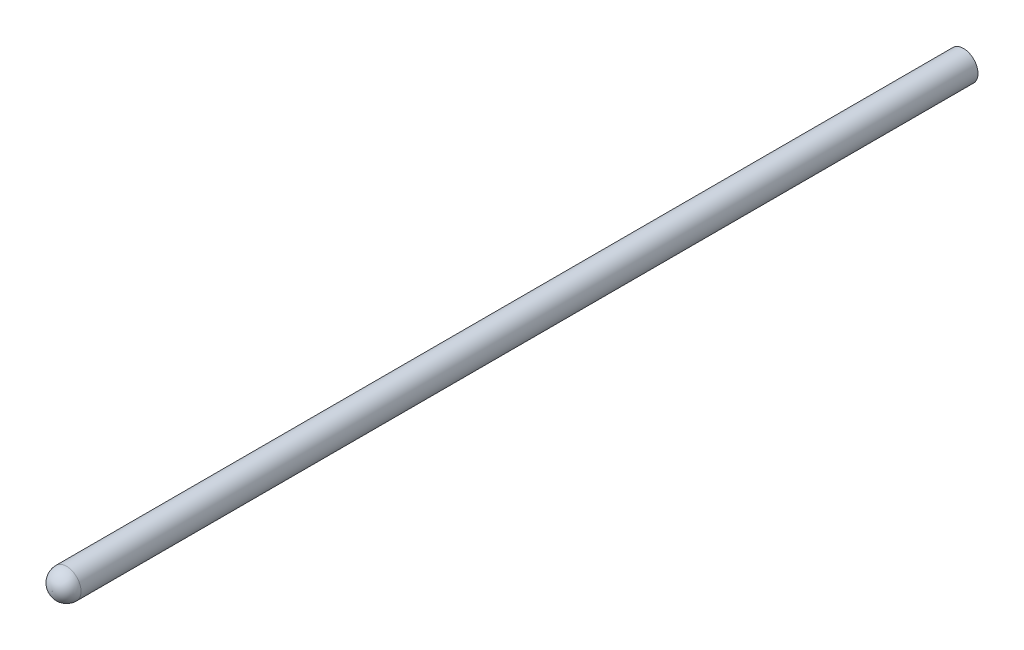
ISO-10303-21;
HEADER;
FILE_DESCRIPTION(('STEP AP214'),'2;1');
FILE_NAME('part.step','',(''),(''),'','','');
FILE_SCHEMA(('AUTOMOTIVE_DESIGN { 1 0 10303 214 1 1 1 1 }'));
ENDSEC;
DATA;
#1=APPLICATION_CONTEXT('core data for automotive mechanical design processes');
#2=APPLICATION_PROTOCOL_DEFINITION('international standard','automotive_design',2000,#1);
#3=PRODUCT_CONTEXT('',#1,'mechanical');
#4=PRODUCT('Part','Part','',(#3));
#5=PRODUCT_RELATED_PRODUCT_CATEGORY('part','',(#4));
#6=PRODUCT_DEFINITION_FORMATION('','',#4);
#7=PRODUCT_DEFINITION_CONTEXT('part definition',#1,'design');
#8=PRODUCT_DEFINITION('design','',#6,#7);
#9=PRODUCT_DEFINITION_SHAPE('','',#8);
#10=(LENGTH_UNIT() NAMED_UNIT(*) SI_UNIT(.MILLI.,.METRE.));
#11=(NAMED_UNIT(*) PLANE_ANGLE_UNIT() SI_UNIT($,.RADIAN.));
#12=(NAMED_UNIT(*) SI_UNIT($,.STERADIAN.) SOLID_ANGLE_UNIT());
#13=UNCERTAINTY_MEASURE_WITH_UNIT(LENGTH_MEASURE(1.E-05),#10,'distance_accuracy_value','');
#14=(GEOMETRIC_REPRESENTATION_CONTEXT(3) GLOBAL_UNCERTAINTY_ASSIGNED_CONTEXT((#13)) GLOBAL_UNIT_ASSIGNED_CONTEXT((#10,
#11,#12)) REPRESENTATION_CONTEXT('',''));
#15=CARTESIAN_POINT('',(0.,0.,0.));
#16=DIRECTION('',(0.,0.,1.));
#17=DIRECTION('',(1.,0.,0.));
#18=AXIS2_PLACEMENT_3D('',#15,#16,#17);
#19=CARTESIAN_POINT('',(0.,0.,203.2));
#20=DIRECTION('',(0.,0.,-1.));
#21=DIRECTION('',(-1.,0.,0.));
#22=AXIS2_PLACEMENT_3D('',#19,#20,#21);
#23=CYLINDRICAL_SURFACE('',#22,3.25);
#24=CARTESIAN_POINT('',(0.,0.,200.025));
#25=DIRECTION('',(0.,0.,1.));
#26=DIRECTION('',(1.,0.,0.));
#27=AXIS2_PLACEMENT_3D('',#24,#25,#26);
#28=CIRCLE('',#27,3.25);
#29=CARTESIAN_POINT('',(3.25,0.,200.025));
#30=VERTEX_POINT('',#29);
#31=EDGE_CURVE('E10',#30,#30,#28,.F.);
#32=ORIENTED_EDGE('',*,*,#31,.T.);
#33=EDGE_LOOP('',(#32));
#34=FACE_BOUND('',#33,.T.);
#35=CARTESIAN_POINT('',(0.,0.,0.));
#36=DIRECTION('',(0.,0.,1.));
#37=DIRECTION('',(1.,0.,0.));
#38=AXIS2_PLACEMENT_3D('',#35,#36,#37);
#39=CIRCLE('',#38,3.25);
#40=CARTESIAN_POINT('',(3.25,0.,0.));
#41=VERTEX_POINT('',#40);
#42=EDGE_CURVE('E56',#41,#41,#39,.T.);
#43=ORIENTED_EDGE('',*,*,#42,.T.);
#44=EDGE_LOOP('',(#43));
#45=FACE_BOUND('',#44,.T.);
#46=ADVANCED_FACE('F43',(#34,#45),#23,.T.);
#47=CARTESIAN_POINT('',(0.,0.,203.2));
#48=DIRECTION('',(0.,0.,1.));
#49=DIRECTION('',(1.,0.,0.));
#50=AXIS2_PLACEMENT_3D('',#47,#48,#49);
#51=PLANE('',#50);
#52=CARTESIAN_POINT('',(0.,0.,203.2));
#53=DIRECTION('',(0.,0.,1.));
#54=DIRECTION('',(1.,0.,0.));
#55=AXIS2_PLACEMENT_3D('',#52,#53,#54);
#56=CIRCLE('',#55,0.0749999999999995);
#57=CARTESIAN_POINT('',(0.0749999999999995,0.,203.2));
#58=VERTEX_POINT('',#57);
#59=EDGE_CURVE('E51',#58,#58,#56,.T.);
#60=ORIENTED_EDGE('',*,*,#59,.T.);
#61=EDGE_LOOP('',(#60));
#62=FACE_BOUND('',#61,.T.);
#63=ADVANCED_FACE('F67',(#62),#51,.T.);
#64=CARTESIAN_POINT('',(0.,0.,0.));
#65=DIRECTION('',(0.,0.,1.));
#66=DIRECTION('',(1.,0.,0.));
#67=AXIS2_PLACEMENT_3D('',#64,#65,#66);
#68=PLANE('',#67);
#69=ORIENTED_EDGE('',*,*,#42,.F.);
#70=EDGE_LOOP('',(#69));
#71=FACE_BOUND('',#70,.T.);
#72=ADVANCED_FACE('F65',(#71),#68,.F.);
#73=CARTESIAN_POINT('',(0.,0.,200.025));
#74=DIRECTION('',(0.,0.,1.));
#75=DIRECTION('',(1.,0.,0.));
#76=AXIS2_PLACEMENT_3D('',#73,#74,#75);
#77=DEGENERATE_TOROIDAL_SURFACE('',#76,0.0749999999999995,3.175,.T.);
#78=ORIENTED_EDGE('',*,*,#31,.F.);
#79=EDGE_LOOP('',(#78));
#80=FACE_BOUND('',#79,.T.);
#81=ORIENTED_EDGE('',*,*,#59,.F.);
#82=EDGE_LOOP('',(#81));
#83=FACE_BOUND('',#82,.T.);
#84=ADVANCED_FACE('F45',(#80,#83),#77,.T.);
#85=CLOSED_SHELL('',(#46,#63,#72,#84));
#86=MANIFOLD_SOLID_BREP('B2',#85);
#87=ADVANCED_BREP_SHAPE_REPRESENTATION('',(#18,#86),#14);
#88=SHAPE_DEFINITION_REPRESENTATION(#9,#87);
ENDSEC;
END-ISO-10303-21;
